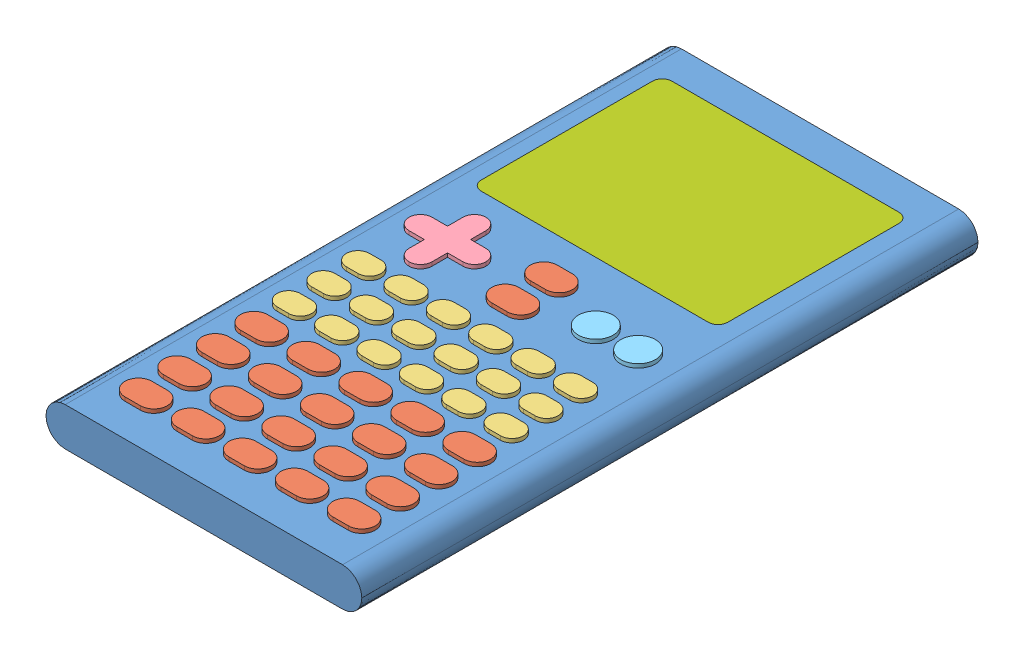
SolidWorks assembly Numworks.SLDASM, configuration Défaut (file format 5000). Lengths in mm.
Overall size (82 11 160).
46 component instances, 7 part files, 23 mates.
Components (placement in the parent):
- Corps-1: Corps.SLDPRT [Défaut] at (-67.0914 -4.0408 80) size (82 10 160)
- Boutton-big-1: Boutton-big.SLDPRT [Défaut] at (-53.0914 4.9592 68) size (11 2 7)
- Boutton-big-2: Boutton-big.SLDPRT [Défaut] at (-53.0914 4.9592 58) size (11 2 7)
- Boutton-big-3: Boutton-big.SLDPRT [Défaut] at (-53.0914 4.9592 48) size (11 2 7)
- Boutton-big-4: Boutton-big.SLDPRT [Défaut] at (-53.0914 4.9592 38) size (11 2 7)
- Boutton-big-5: Boutton-big.SLDPRT [Défaut] at (-39.5914 4.9592 68) size (11 2 7)
- Boutton-big-6: Boutton-big.SLDPRT [Défaut] at (-39.5914 4.9592 58) size (11 2 7)
- Boutton-big-7: Boutton-big.SLDPRT [Défaut] at (-39.5914 4.9592 48) size (11 2 7)
- Boutton-big-8: Boutton-big.SLDPRT [Défaut] at (-39.5914 4.9592 38) size (11 2 7)
- Boutton-big-9: Boutton-big.SLDPRT [Défaut] at (-26.0914 4.9592 68) size (11 2 7)
- Boutton-big-10: Boutton-big.SLDPRT [Défaut] at (-26.0914 4.9592 58) size (11 2 7)
- Boutton-big-11: Boutton-big.SLDPRT [Défaut] at (-26.0914 4.9592 48) size (11 2 7)
- Boutton-big-12: Boutton-big.SLDPRT [Défaut] at (-26.0914 4.9592 38) size (11 2 7)
- Boutton-big-13: Boutton-big.SLDPRT [Défaut] at (-12.5914 4.9592 68) size (11 2 7)
- Boutton-big-14: Boutton-big.SLDPRT [Défaut] at (-12.5914 4.9592 58) size (11 2 7)
- Boutton-big-15: Boutton-big.SLDPRT [Défaut] at (-12.5914 4.9592 48) size (11 2 7)
- Boutton-big-16: Boutton-big.SLDPRT [Défaut] at (-12.5914 4.9592 38) size (11 2 7)
- Boutton-big-17: Boutton-big.SLDPRT [Défaut] at (0.9086 4.9592 68) size (11 2 7)
- Boutton-big-18: Boutton-big.SLDPRT [Défaut] at (0.9086 4.9592 58) size (11 2 7)
- Boutton-big-19: Boutton-big.SLDPRT [Défaut] at (0.9086 4.9592 48) size (11 2 7)
- Boutton-big-20: Boutton-big.SLDPRT [Défaut] at (0.9086 4.9592 38) size (11 2 7)
- Boutton-small-1: Boutton-small.SLDPRT [Défaut] at (-54.0914 4.9592 28.5) size (9 2 6)
- Boutton-small-2: Boutton-small.SLDPRT [Défaut] at (-54.0914 4.9592 19.5) size (9 2 6)
- Boutton-small-3: Boutton-small.SLDPRT [Défaut] at (-54.0914 4.9592 10.5) size (9 2 6)
- Boutton-small-4: Boutton-small.SLDPRT [Défaut] at (-43.0914 4.9592 28.5) size (9 2 6)
- Boutton-small-5: Boutton-small.SLDPRT [Défaut] at (-43.0914 4.9592 19.5) size (9 2 6)
- Boutton-small-6: Boutton-small.SLDPRT [Défaut] at (-43.0914 4.9592 10.5) size (9 2 6)
- Boutton-small-7: Boutton-small.SLDPRT [Défaut] at (-32.0914 4.9592 28.5) size (9 2 6)
- Boutton-small-8: Boutton-small.SLDPRT [Défaut] at (-32.0914 4.9592 19.5) size (9 2 6)
- Boutton-small-9: Boutton-small.SLDPRT [Défaut] at (-32.0914 4.9592 10.5) size (9 2 6)
- Boutton-small-10: Boutton-small.SLDPRT [Défaut] at (-21.0914 4.9592 28.5) size (9 2 6)
- Boutton-small-11: Boutton-small.SLDPRT [Défaut] at (-21.0914 4.9592 19.5) size (9 2 6)
- Boutton-small-12: Boutton-small.SLDPRT [Défaut] at (-21.0914 4.9592 10.5) size (9 2 6)
- Boutton-small-13: Boutton-small.SLDPRT [Défaut] at (-10.0914 4.9592 28.5) size (9 2 6)
- Boutton-small-14: Boutton-small.SLDPRT [Défaut] at (-10.0914 4.9592 19.5) size (9 2 6)
- Boutton-small-15: Boutton-small.SLDPRT [Défaut] at (-10.0914 4.9592 10.5) size (9 2 6)
- Boutton-small-16: Boutton-small.SLDPRT [Défaut] at (0.9086 4.9592 28.5) size (9 2 6)
- Boutton-small-17: Boutton-small.SLDPRT [Défaut] at (0.9086 4.9592 19.5) size (9 2 6)
- Boutton-small-18: Boutton-small.SLDPRT [Défaut] at (0.9086 4.9592 10.5) size (9 2 6)
- Boutton-cross-1: Boutton-cross.SLDPRT [Défaut] at (-48.5914 4.9592 -5.75) size (20 2 20)
- Boutton-circle-1: Boutton-circle.SLDPRT [Défaut] at (0.9086 4.9592 -5.75) x (0.194385 0 0.980925) z (-0.980925 0 0.194385) size (9 2 9)
- Boutton-circle-2: Boutton-circle.SLDPRT [Défaut] at (-10.0914 4.9592 -5.75) x (0.194385 0 0.980925) z (-0.980925 0 0.194385) size (9 2 9)
- Boutton-big-21: Boutton-big.SLDPRT [Défaut] at (-26.5914 4.9592 -10.75) size (11 2 7)
- Boutton-big-22: Boutton-big.SLDPRT [Défaut] at (-26.5914 4.9592 -0.75) size (11 2 7)
- Ecran-1: Ecran.SLDPRT [Défaut] at (-55.5914 3.9592 -25) size (58 1 43.5)
- Ecran-protector-1: Ecran-protector.SLDPRT [Défaut] at (-58.5914 4.9592 -22) size (64 1 49.5)
Mates (geometry in assembly coordinates):
- Coïncidente1: coincident anti-aligned: plane of Corps-1 through (-55.0914 4.9592 68) normal (0 1 0); plane of Boutton-big-1 through (-55.0914 4.9592 68) normal (0 -1 0)
- Coïncidente2: coincident anti-aligned: plane of Corps-1 through (-55.0914 4.9592 71.5) normal (0 0 -1); plane of Boutton-big-1 through (-55.0914 6.9592 71.5) normal (0 0 1)
- Coaxiale1: concentric anti-aligned: cylinder of Corps-1 through (-51.0914 4.9592 68) axis (0 1 0) radius 3.5; cylinder of Boutton-big-1 through (-51.0914 6.9592 68) axis (0 -1 0) radius 3.5
- Coïncidente3: coincident anti-aligned: plane of Corps-1 through (-55.5914 4.9592 28.5) normal (0 1 0); plane of Boutton-small-1 through (-55.5914 4.9592 28.5) normal (0 -1 0)
- Coïncidente4: coincident anti-aligned: plane of Corps-1 through (-55.5914 4.9592 31.5) normal (0 0 -1); plane of Boutton-small-1 through (-55.5914 6.9592 31.5) normal (0 0 1)
- Coaxiale2: concentric anti-aligned: cylinder of Corps-1 through (-52.5914 4.9592 28.5) axis (0 1 0) radius 3; cylinder of Boutton-small-1 through (-52.5914 6.9592 28.5) axis (0 -1 0) radius 3
- Coïncidente5: coincident anti-aligned: plane of Corps-1 through (-67.0914 4.9592 80) normal (0 1 0); plane of Boutton-cross-1 through (-48.5914 4.9592 -5.75) normal (0 -1 0)
- Coïncidente6: coincident anti-aligned: plane of Corps-1 through (-38.5914 4.9592 -2.75) normal (0 0 -1); plane of Boutton-cross-1 through (-38.5914 6.9592 -2.75) normal (0 0 1)
- Coïncidente7: coincident anti-aligned: plane of Corps-1 through (-45.5914 4.9592 -2.75) normal (-1 0 0); plane of Boutton-cross-1 through (-45.5914 6.9592 -2.75) normal (1 0 0)
- Coïncidente8: coincident anti-aligned: plane of Corps-1 through (0.9086 4.9592 -5.75) normal (0 1 0); plane of Boutton-circle-1 through (0.9086 4.9592 -5.75) normal (0 -1 0)
- Coaxiale3: concentric anti-aligned: cylinder of Corps-1 through (0.9086 4.9592 -5.75) axis (0 1 0) radius 4.5; cylinder of Boutton-circle-1 through (0.9086 6.9592 -5.75) axis (0 -1 0) radius 4.5
- Coïncidente9: coincident anti-aligned: plane of Corps-1 through (-28.5914 4.9592 -0.75) normal (0 1 0); plane of Boutton-big-22 through (-28.5914 4.9592 -0.75) normal (0 -1 0)
- Coïncidente10: coincident anti-aligned: plane of Corps-1 through (-28.5914 4.9592 2.75) normal (0 0 -1); plane of Boutton-big-22 through (-28.5914 6.9592 2.75) normal (0 0 1)
- Coaxiale4: concentric anti-aligned: cylinder of Corps-1 through (-24.5914 4.9592 -0.75) axis (0 1 0) radius 3.5; cylinder of Boutton-big-22 through (-24.5914 6.9592 -0.75) axis (0 -1 0) radius 3.5
- Coïncidente11: coincident anti-aligned: plane of Corps-1 through (-28.5914 4.9592 -10.75) normal (0 1 0); plane of Boutton-big-21 through (-28.5914 4.9592 -10.75) normal (0 -1 0)
- Coïncidente12: coincident anti-aligned: plane of Corps-1 through (-28.5914 4.9592 -7.25) normal (0 0 -1); plane of Boutton-big-21 through (-28.5914 6.9592 -7.25) normal (0 0 1)
- Coaxiale5: concentric anti-aligned: cylinder of Corps-1 through (-24.5914 4.9592 -10.75) axis (0 1 0) radius 3.5; cylinder of Boutton-big-21 through (-24.5914 6.9592 -10.75) axis (0 -1 0) radius 3.5
- Coïncidente13: coincident: plane of Corps-1 through (-67.0914 3.9592 80) normal (0 1 0); plane of Ecran-1 through (-55.5914 3.9592 -25) normal (0 -1 0)
- Coïncidente14: coincident: plane of Corps-1 through (-55.5914 3.9592 -68.5) normal (0 0 1); plane of Ecran-1 through (-55.5914 4.9592 -68.5) normal (0 0 -1)
- Coïncidente15: coincident anti-aligned: plane of Corps-1 through (-55.5914 3.9592 -68.5) normal (1 0 0); plane of Ecran-1 through (-55.5914 4.9592 -25) normal (-1 0 0)
- Coïncidente16: coincident: plane of Corps-1 through (-67.0914 4.9592 80) normal (0 1 0); plane of Ecran-protector-1 through (-58.5914 4.9592 -22) normal (0 -1 0)
- Coïncidente17: coincident: plane of Corps-1 through (-58.5914 4.9592 -71.5) normal (0 0 1); plane of Ecran-protector-1 through (-58.5914 5.9592 -71.5) normal (0 0 -1)
- Coïncidente18: coincident anti-aligned: plane of Corps-1 through (5.4086 4.9592 -71.5) normal (-1 0 0); plane of Ecran-protector-1 through (5.4086 5.9592 -22) normal (1 0 0)
